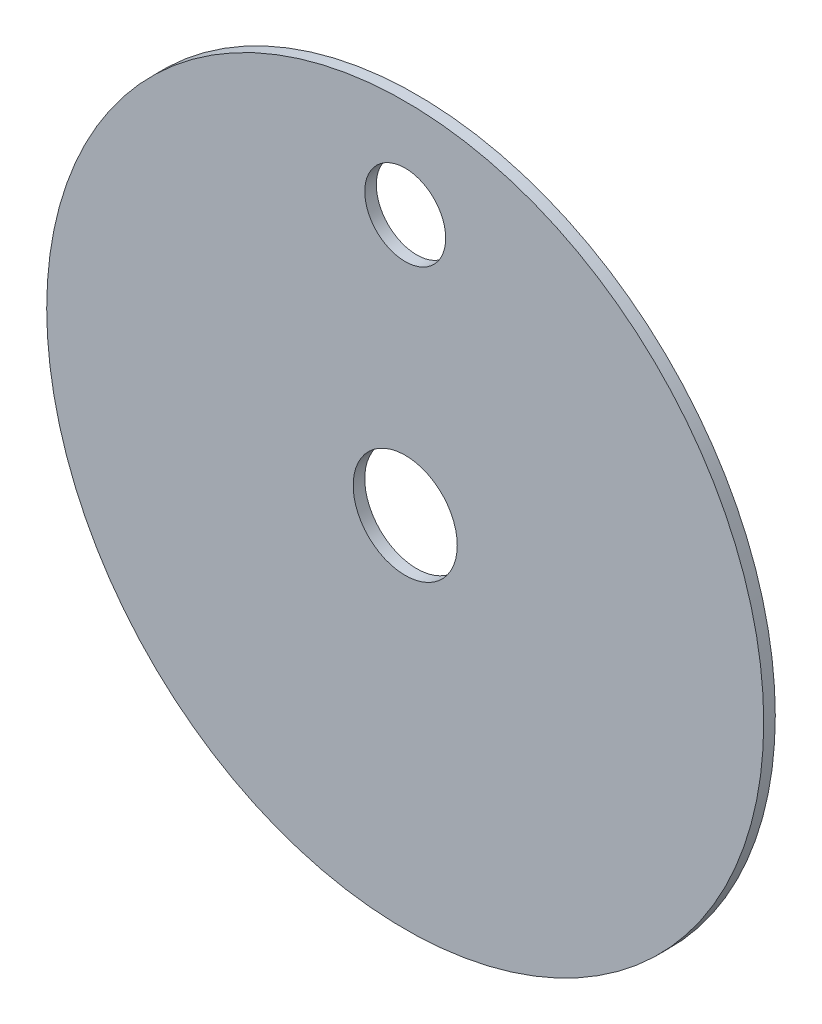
from build123d import *

# Parameters (mm, degrees)
ESQUISSE1_R        = 31
ESQUISSE1_R_2      = 3.5
ESQUISSE1_R_3      = 4.5
BOSS_EXTRU_1_DEPTH = 1


with BuildPart() as part:
    # Esquisse1 → Boss.-Extru.1 (new body)
    with BuildSketch(Plane(origin=(0, 0, -0.5), x_dir=(-1, 0, 0), z_dir=(0, 0, -1))):
        with Locations(Location((0, 0, 0), (0, 0, 180))):
            Circle(ESQUISSE1_R)
        with Locations(Location((0, 22.5, 0), (0, 0, 180))):
            Circle(ESQUISSE1_R_2, mode=Mode.SUBTRACT)
        with Locations(Location((0, 0, 0), (0, 0, 180))):
            Circle(ESQUISSE1_R_3, mode=Mode.SUBTRACT)
    extrude(amount=-BOSS_EXTRU_1_DEPTH)


solid = part.part
